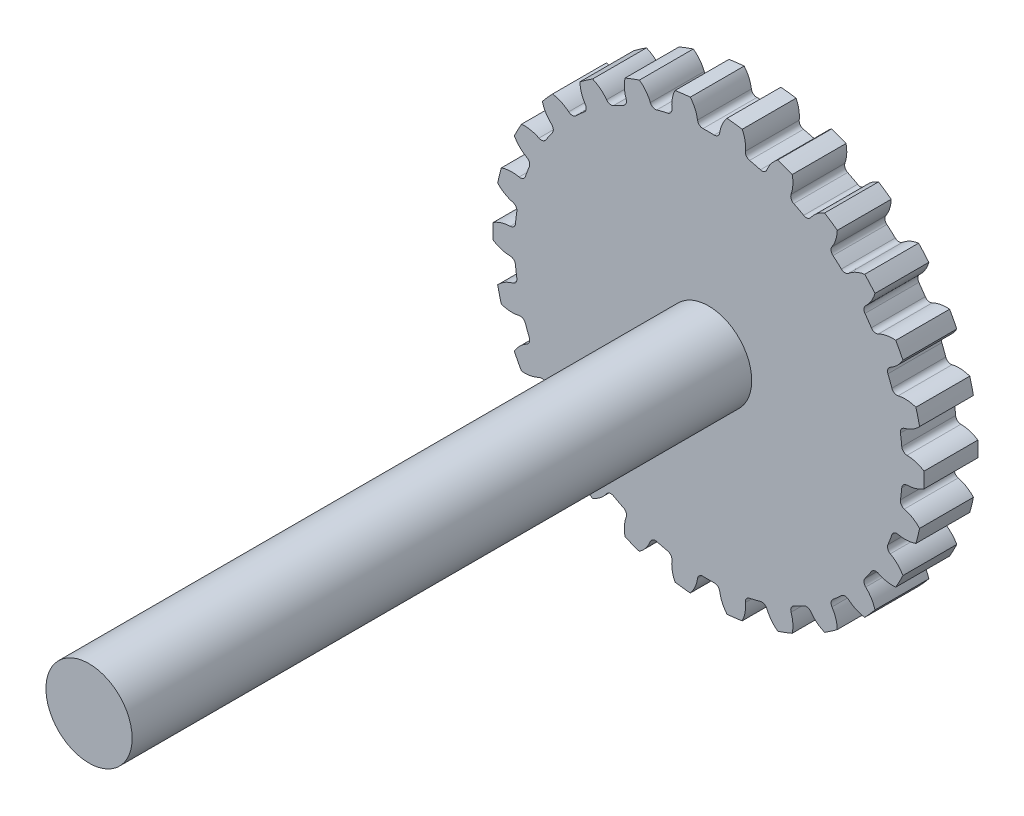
from build123d import *

# Parameters (mm, degrees)
IZIM1_R                     = 200
Y_KSEKLIK_EKSTR_ZYON1_DEPTH = 50
KES_EKSTR_ZYON1_DEPTH       = 50
DAIRESEL_O_ALTMA1_COUNT     = 26
IZIM3_R                     = 40
Y_KSEKLIK_EKSTR_ZYON2_DEPTH = 425
IZIM4_R                     = 40
Y_KSEKLIK_EKSTR_ZYON3_DEPTH = 150


with BuildPart() as part:
    # izim1 → Y_kseklik-Ekstr_zyon1 (new body)
    with BuildSketch(Plane.XY):
        Circle(IZIM1_R)
    extrude(amount=Y_KSEKLIK_EKSTR_ZYON1_DEPTH)

    # izim2 → Kes-Ekstr_zyon1 (cut)
    with BuildSketch(Plane.XY.offset(50)):
        with BuildLine():
            ThreePointArc((5.203374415, 179.924775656), (0, 180), (-5.203374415, 179.924775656))
            ThreePointArc((-5.203374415, 179.924775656), (-8.570470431, 181.099713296), (-10.298210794, 184.21944522))
            ThreePointArc((-10.298210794, 184.21944522), (-16.501264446, 198.649649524), (-29.145809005, 207.967597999))
            ThreePointArc((-29.145809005, 207.967597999), (0, 210), (29.145809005, 207.967597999))
            ThreePointArc((29.145809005, 207.967597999), (16.501264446, 198.649649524), (10.298210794, 184.21944522))
            ThreePointArc((10.298210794, 184.21944522), (8.570470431, 181.099713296), (5.203374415, 179.924775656))
        make_face()
    kes_ekstr_zyon1 = extrude(amount=-KES_EKSTR_ZYON1_DEPTH, mode=Mode.SUBTRACT)

    # Dairesel _o_altma1: Kes-Ekstr_zyon1 ×26 about axis
    dairesel_o_altma1_axis = Axis((0, 0, 0), (0, 0, 1))
    for i in range(1, DAIRESEL_O_ALTMA1_COUNT):
        add(kes_ekstr_zyon1.rotate(dairesel_o_altma1_axis, i * 360 / DAIRESEL_O_ALTMA1_COUNT), mode=Mode.SUBTRACT)

    # izim3 → Y_kseklik-Ekstr_zyon2 (add)
    with BuildSketch(Plane.XY.offset(50)):
        Circle(IZIM3_R)
    extrude(amount=Y_KSEKLIK_EKSTR_ZYON2_DEPTH)

    # izim4 → Y_kseklik-Ekstr_zyon3 (add)
    with BuildSketch(Plane.XY.offset(475)):
        Circle(IZIM4_R)
    extrude(amount=Y_KSEKLIK_EKSTR_ZYON3_DEPTH)


solid = part.part
